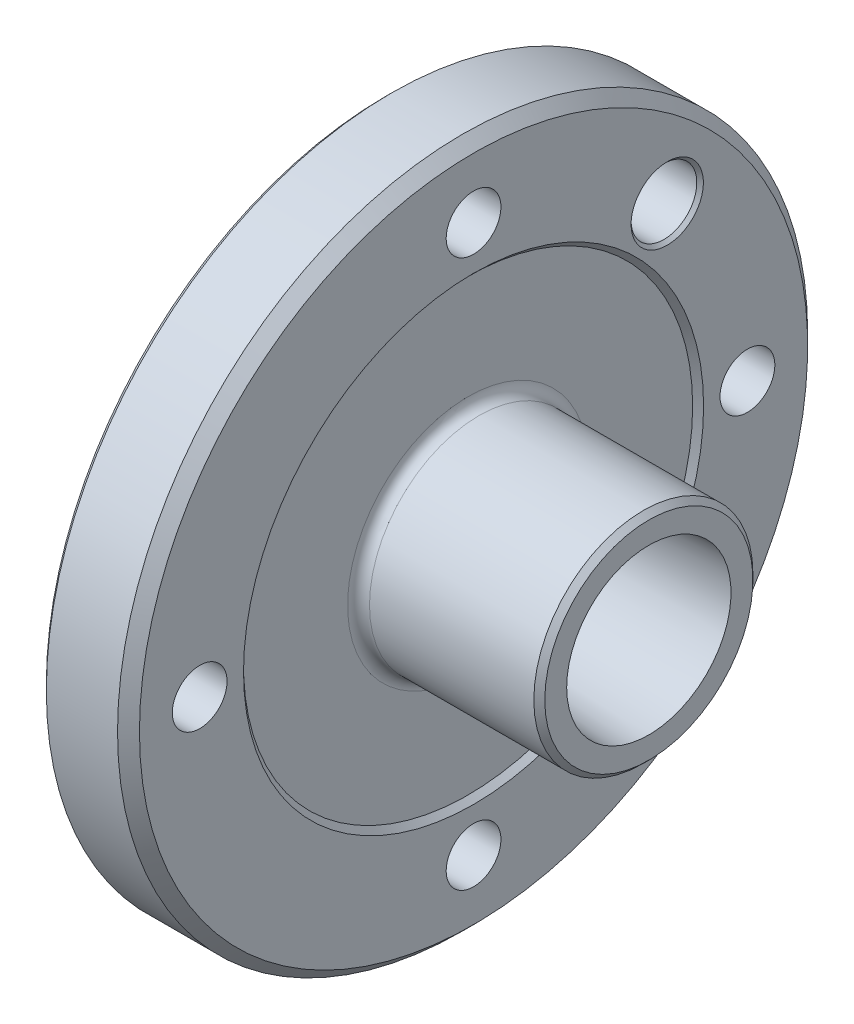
ISO-10303-21;
HEADER;
FILE_DESCRIPTION(('STEP AP214'),'2;1');
FILE_NAME('part.step','',(''),(''),'','','');
FILE_SCHEMA(('AUTOMOTIVE_DESIGN { 1 0 10303 214 1 1 1 1 }'));
ENDSEC;
DATA;
#1=APPLICATION_CONTEXT('core data for automotive mechanical design processes');
#2=APPLICATION_PROTOCOL_DEFINITION('international standard','automotive_design',2000,#1);
#3=PRODUCT_CONTEXT('',#1,'mechanical');
#4=PRODUCT('Part','Part','',(#3));
#5=PRODUCT_RELATED_PRODUCT_CATEGORY('part','',(#4));
#6=PRODUCT_DEFINITION_FORMATION('','',#4);
#7=PRODUCT_DEFINITION_CONTEXT('part definition',#1,'design');
#8=PRODUCT_DEFINITION('design','',#6,#7);
#9=PRODUCT_DEFINITION_SHAPE('','',#8);
#10=(LENGTH_UNIT() NAMED_UNIT(*) SI_UNIT(.MILLI.,.METRE.));
#11=(NAMED_UNIT(*) PLANE_ANGLE_UNIT() SI_UNIT($,.RADIAN.));
#12=(NAMED_UNIT(*) SI_UNIT($,.STERADIAN.) SOLID_ANGLE_UNIT());
#13=UNCERTAINTY_MEASURE_WITH_UNIT(LENGTH_MEASURE(1.E-05),#10,'distance_accuracy_value','');
#14=(GEOMETRIC_REPRESENTATION_CONTEXT(3) GLOBAL_UNCERTAINTY_ASSIGNED_CONTEXT((#13)) GLOBAL_UNIT_ASSIGNED_CONTEXT((#10,
#11,#12)) REPRESENTATION_CONTEXT('',''));
#15=CARTESIAN_POINT('',(0.,0.,0.));
#16=DIRECTION('',(0.,0.,1.));
#17=DIRECTION('',(1.,0.,0.));
#18=AXIS2_PLACEMENT_3D('',#15,#16,#17);
#19=CARTESIAN_POINT('',(5.5,6.575,0.));
#20=DIRECTION('',(-1.,0.,0.));
#21=DIRECTION('',(0.,0.,1.));
#22=AXIS2_PLACEMENT_3D('',#19,#20,#21);
#23=PLANE('',#22);
#24=CARTESIAN_POINT('',(5.5,0.,0.));
#25=DIRECTION('',(-1.,0.,0.));
#26=DIRECTION('',(0.,0.,1.));
#27=AXIS2_PLACEMENT_3D('',#24,#25,#26);
#28=CIRCLE('',#27,3.3);
#29=CARTESIAN_POINT('',(5.5,0.,3.3));
#30=VERTEX_POINT('',#29);
#31=EDGE_CURVE('E94',#30,#30,#28,.T.);
#32=ORIENTED_EDGE('',*,*,#31,.T.);
#33=EDGE_LOOP('',(#32));
#34=FACE_BOUND('',#33,.T.);
#35=CARTESIAN_POINT('',(5.5,0.,0.));
#36=DIRECTION('',(-1.,0.,0.));
#37=DIRECTION('',(0.,0.,1.));
#38=AXIS2_PLACEMENT_3D('',#35,#36,#37);
#39=CIRCLE('',#38,6.575);
#40=CARTESIAN_POINT('',(5.5,0.,6.575));
#41=VERTEX_POINT('',#40);
#42=EDGE_CURVE('E126',#41,#41,#39,.T.);
#43=ORIENTED_EDGE('',*,*,#42,.F.);
#44=EDGE_LOOP('',(#43));
#45=FACE_BOUND('',#44,.T.);
#46=ADVANCED_FACE('F58',(#34,#45),#23,.F.);
#47=CARTESIAN_POINT('',(0.,0.,0.));
#48=DIRECTION('',(1.,0.,0.));
#49=DIRECTION('',(0.,0.,-1.));
#50=AXIS2_PLACEMENT_3D('',#47,#48,#49);
#51=PLANE('',#50);
#52=CARTESIAN_POINT('',(0.,17.6776695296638,-17.6776695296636));
#53=DIRECTION('',(1.,0.,0.));
#54=DIRECTION('',(0.,0.,-1.));
#55=AXIS2_PLACEMENT_3D('',#52,#53,#54);
#56=CIRCLE('',#55,3.30000000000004);
#57=CARTESIAN_POINT('',(0.,17.6776695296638,-20.9776695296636));
#58=VERTEX_POINT('',#57);
#59=EDGE_CURVE('E65',#58,#58,#56,.T.);
#60=ORIENTED_EDGE('',*,*,#59,.T.);
#61=EDGE_LOOP('',(#60));
#62=FACE_BOUND('',#61,.T.);
#63=CARTESIAN_POINT('',(0.,0.,0.));
#64=DIRECTION('',(-1.,0.,0.));
#65=DIRECTION('',(0.,0.,1.));
#66=AXIS2_PLACEMENT_3D('',#63,#64,#65);
#67=CIRCLE('',#66,6.855);
#68=CARTESIAN_POINT('',(0.,0.,6.855));
#69=VERTEX_POINT('',#68);
#70=EDGE_CURVE('E141',#69,#69,#67,.T.);
#71=ORIENTED_EDGE('',*,*,#70,.F.);
#72=EDGE_LOOP('',(#71));
#73=FACE_BOUND('',#72,.T.);
#74=CARTESIAN_POINT('',(0.,0.,0.));
#75=DIRECTION('',(1.,0.,0.));
#76=DIRECTION('',(0.,0.,-1.));
#77=AXIS2_PLACEMENT_3D('',#74,#75,#76);
#78=CIRCLE('',#77,31.);
#79=CARTESIAN_POINT('',(0.,0.,-31.));
#80=VERTEX_POINT('',#79);
#81=EDGE_CURVE('E107',#80,#80,#78,.F.);
#82=ORIENTED_EDGE('',*,*,#81,.T.);
#83=EDGE_LOOP('',(#82));
#84=FACE_BOUND('',#83,.T.);
#85=CARTESIAN_POINT('',(0.,2.61861100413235E-13,25.));
#86=DIRECTION('',(-1.,0.,0.));
#87=DIRECTION('',(0.,0.,1.));
#88=AXIS2_PLACEMENT_3D('',#85,#86,#87);
#89=CIRCLE('',#88,2.5);
#90=CARTESIAN_POINT('',(0.,2.61861100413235E-13,27.5));
#91=VERTEX_POINT('',#90);
#92=EDGE_CURVE('E97',#91,#91,#89,.T.);
#93=ORIENTED_EDGE('',*,*,#92,.F.);
#94=EDGE_LOOP('',(#93));
#95=FACE_BOUND('',#94,.T.);
#96=CARTESIAN_POINT('',(0.,-25.,0.));
#97=DIRECTION('',(-1.,0.,0.));
#98=DIRECTION('',(0.,0.,1.));
#99=AXIS2_PLACEMENT_3D('',#96,#97,#98);
#100=CIRCLE('',#99,2.5);
#101=CARTESIAN_POINT('',(0.,-25.,2.5));
#102=VERTEX_POINT('',#101);
#103=EDGE_CURVE('E114',#102,#102,#100,.T.);
#104=ORIENTED_EDGE('',*,*,#103,.F.);
#105=EDGE_LOOP('',(#104));
#106=FACE_BOUND('',#105,.T.);
#107=CARTESIAN_POINT('',(0.,0.,-25.));
#108=DIRECTION('',(-1.,0.,0.));
#109=DIRECTION('',(0.,0.,1.));
#110=AXIS2_PLACEMENT_3D('',#107,#108,#109);
#111=CIRCLE('',#110,2.5);
#112=CARTESIAN_POINT('',(0.,0.,-22.5));
#113=VERTEX_POINT('',#112);
#114=EDGE_CURVE('E118',#113,#113,#111,.T.);
#115=ORIENTED_EDGE('',*,*,#114,.F.);
#116=EDGE_LOOP('',(#115));
#117=FACE_BOUND('',#116,.T.);
#118=CARTESIAN_POINT('',(0.,25.,0.));
#119=DIRECTION('',(-1.,0.,0.));
#120=DIRECTION('',(0.,0.,1.));
#121=AXIS2_PLACEMENT_3D('',#118,#119,#120);
#122=CIRCLE('',#121,2.5);
#123=CARTESIAN_POINT('',(0.,25.,2.5));
#124=VERTEX_POINT('',#123);
#125=EDGE_CURVE('E122',#124,#124,#122,.T.);
#126=ORIENTED_EDGE('',*,*,#125,.F.);
#127=EDGE_LOOP('',(#126));
#128=FACE_BOUND('',#127,.T.);
#129=ADVANCED_FACE('F165',(#62,#73,#84,#95,#106,#117,#128),#51,.F.);
#130=CARTESIAN_POINT('',(0.,0.,0.));
#131=DIRECTION('',(-1.,0.,0.));
#132=DIRECTION('',(0.,0.,1.));
#133=AXIS2_PLACEMENT_3D('',#130,#131,#132);
#134=CYLINDRICAL_SURFACE('',#133,31.5);
#135=CARTESIAN_POINT('',(7.,0.,0.));
#136=DIRECTION('',(-1.,0.,0.));
#137=DIRECTION('',(0.,0.,1.));
#138=AXIS2_PLACEMENT_3D('',#135,#136,#137);
#139=CIRCLE('',#138,31.5);
#140=CARTESIAN_POINT('',(7.,0.,31.5));
#141=VERTEX_POINT('',#140);
#142=EDGE_CURVE('E90',#141,#141,#139,.T.);
#143=ORIENTED_EDGE('',*,*,#142,.T.);
#144=EDGE_LOOP('',(#143));
#145=FACE_BOUND('',#144,.T.);
#146=CARTESIAN_POINT('',(0.500000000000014,0.,0.));
#147=DIRECTION('',(1.,0.,0.));
#148=DIRECTION('',(0.,0.,-1.));
#149=AXIS2_PLACEMENT_3D('',#146,#147,#148);
#150=CIRCLE('',#149,31.5);
#151=CARTESIAN_POINT('',(0.500000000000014,0.,-31.5));
#152=VERTEX_POINT('',#151);
#153=EDGE_CURVE('E104',#152,#152,#150,.T.);
#154=ORIENTED_EDGE('',*,*,#153,.T.);
#155=EDGE_LOOP('',(#154));
#156=FACE_BOUND('',#155,.T.);
#157=ADVANCED_FACE('F171',(#145,#156),#134,.T.);
#158=CARTESIAN_POINT('',(8.,31.5,0.));
#159=DIRECTION('',(-1.,0.,0.));
#160=DIRECTION('',(0.,0.,1.));
#161=AXIS2_PLACEMENT_3D('',#158,#159,#160);
#162=PLANE('',#161);
#163=CARTESIAN_POINT('',(8.,17.6776695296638,-17.6776695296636));
#164=DIRECTION('',(-1.,0.,0.));
#165=DIRECTION('',(0.,0.,1.));
#166=AXIS2_PLACEMENT_3D('',#163,#164,#165);
#167=CIRCLE('',#166,3.30000000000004);
#168=CARTESIAN_POINT('',(8.,17.6776695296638,-14.3776695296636));
#169=VERTEX_POINT('',#168);
#170=EDGE_CURVE('E11',#169,#169,#167,.T.);
#171=ORIENTED_EDGE('',*,*,#170,.T.);
#172=EDGE_LOOP('',(#171));
#173=FACE_BOUND('',#172,.T.);
#174=CARTESIAN_POINT('',(8.,0.,0.));
#175=DIRECTION('',(-1.,0.,0.));
#176=DIRECTION('',(0.,0.,1.));
#177=AXIS2_PLACEMENT_3D('',#174,#175,#176);
#178=CIRCLE('',#177,21.);
#179=CARTESIAN_POINT('',(8.,0.,21.));
#180=VERTEX_POINT('',#179);
#181=EDGE_CURVE('E78',#180,#180,#178,.T.);
#182=ORIENTED_EDGE('',*,*,#181,.T.);
#183=EDGE_LOOP('',(#182));
#184=FACE_BOUND('',#183,.T.);
#185=CARTESIAN_POINT('',(8.,0.,0.));
#186=DIRECTION('',(-1.,0.,0.));
#187=DIRECTION('',(0.,0.,1.));
#188=AXIS2_PLACEMENT_3D('',#185,#186,#187);
#189=CIRCLE('',#188,30.5);
#190=CARTESIAN_POINT('',(8.,0.,30.5));
#191=VERTEX_POINT('',#190);
#192=EDGE_CURVE('E87',#191,#191,#189,.F.);
#193=ORIENTED_EDGE('',*,*,#192,.T.);
#194=EDGE_LOOP('',(#193));
#195=FACE_BOUND('',#194,.T.);
#196=CARTESIAN_POINT('',(8.,2.61861100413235E-13,25.));
#197=DIRECTION('',(-1.,0.,0.));
#198=DIRECTION('',(0.,0.,1.));
#199=AXIS2_PLACEMENT_3D('',#196,#197,#198);
#200=CIRCLE('',#199,2.5);
#201=CARTESIAN_POINT('',(8.,2.61861100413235E-13,27.5));
#202=VERTEX_POINT('',#201);
#203=EDGE_CURVE('E111',#202,#202,#200,.T.);
#204=ORIENTED_EDGE('',*,*,#203,.T.);
#205=EDGE_LOOP('',(#204));
#206=FACE_BOUND('',#205,.T.);
#207=CARTESIAN_POINT('',(8.,-25.,0.));
#208=DIRECTION('',(-1.,0.,0.));
#209=DIRECTION('',(0.,0.,1.));
#210=AXIS2_PLACEMENT_3D('',#207,#208,#209);
#211=CIRCLE('',#210,2.5);
#212=CARTESIAN_POINT('',(8.,-25.,2.5));
#213=VERTEX_POINT('',#212);
#214=EDGE_CURVE('E115',#213,#213,#211,.T.);
#215=ORIENTED_EDGE('',*,*,#214,.T.);
#216=EDGE_LOOP('',(#215));
#217=FACE_BOUND('',#216,.T.);
#218=CARTESIAN_POINT('',(8.,0.,-25.));
#219=DIRECTION('',(-1.,0.,0.));
#220=DIRECTION('',(0.,0.,1.));
#221=AXIS2_PLACEMENT_3D('',#218,#219,#220);
#222=CIRCLE('',#221,2.5);
#223=CARTESIAN_POINT('',(8.,0.,-22.5));
#224=VERTEX_POINT('',#223);
#225=EDGE_CURVE('E119',#224,#224,#222,.T.);
#226=ORIENTED_EDGE('',*,*,#225,.T.);
#227=EDGE_LOOP('',(#226));
#228=FACE_BOUND('',#227,.T.);
#229=CARTESIAN_POINT('',(8.,25.,0.));
#230=DIRECTION('',(-1.,0.,0.));
#231=DIRECTION('',(0.,0.,1.));
#232=AXIS2_PLACEMENT_3D('',#229,#230,#231);
#233=CIRCLE('',#232,2.5);
#234=CARTESIAN_POINT('',(8.,25.,2.5));
#235=VERTEX_POINT('',#234);
#236=EDGE_CURVE('E123',#235,#235,#233,.T.);
#237=ORIENTED_EDGE('',*,*,#236,.T.);
#238=EDGE_LOOP('',(#237));
#239=FACE_BOUND('',#238,.T.);
#240=ADVANCED_FACE('F204',(#173,#184,#195,#206,#217,#228,#239),#162,.F.);
#241=CARTESIAN_POINT('',(0.,0.,0.));
#242=DIRECTION('',(-1.,0.,0.));
#243=DIRECTION('',(0.,0.,1.));
#244=AXIS2_PLACEMENT_3D('',#241,#242,#243);
#245=CYLINDRICAL_SURFACE('',#244,10.);
#246=CARTESIAN_POINT('',(8.5,0.,0.));
#247=DIRECTION('',(1.,0.,0.));
#248=DIRECTION('',(0.,0.,-1.));
#249=AXIS2_PLACEMENT_3D('',#246,#247,#248);
#250=CIRCLE('',#249,10.);
#251=CARTESIAN_POINT('',(8.5,0.,-10.));
#252=VERTEX_POINT('',#251);
#253=EDGE_CURVE('E84',#252,#252,#250,.T.);
#254=ORIENTED_EDGE('',*,*,#253,.T.);
#255=EDGE_LOOP('',(#254));
#256=FACE_BOUND('',#255,.T.);
#257=CARTESIAN_POINT('',(23.5,0.,0.));
#258=DIRECTION('',(-1.,0.,0.));
#259=DIRECTION('',(0.,0.,1.));
#260=AXIS2_PLACEMENT_3D('',#257,#258,#259);
#261=CIRCLE('',#260,10.);
#262=CARTESIAN_POINT('',(23.5,0.,10.));
#263=VERTEX_POINT('',#262);
#264=EDGE_CURVE('E101',#263,#263,#261,.T.);
#265=ORIENTED_EDGE('',*,*,#264,.T.);
#266=EDGE_LOOP('',(#265));
#267=FACE_BOUND('',#266,.T.);
#268=ADVANCED_FACE('F227',(#256,#267),#245,.T.);
#269=CARTESIAN_POINT('',(24.,10.,0.));
#270=DIRECTION('',(-1.,0.,0.));
#271=DIRECTION('',(0.,0.,1.));
#272=AXIS2_PLACEMENT_3D('',#269,#270,#271);
#273=PLANE('',#272);
#274=CARTESIAN_POINT('',(24.,0.,0.));
#275=DIRECTION('',(-1.,0.,0.));
#276=DIRECTION('',(0.,0.,1.));
#277=AXIS2_PLACEMENT_3D('',#274,#275,#276);
#278=CIRCLE('',#277,9.5);
#279=CARTESIAN_POINT('',(24.,0.,9.5));
#280=VERTEX_POINT('',#279);
#281=EDGE_CURVE('E93',#280,#280,#278,.F.);
#282=ORIENTED_EDGE('',*,*,#281,.T.);
#283=EDGE_LOOP('',(#282));
#284=FACE_BOUND('',#283,.T.);
#285=CARTESIAN_POINT('',(24.,0.,0.));
#286=DIRECTION('',(-1.,0.,0.));
#287=DIRECTION('',(0.,0.,1.));
#288=AXIS2_PLACEMENT_3D('',#285,#286,#287);
#289=CIRCLE('',#288,7.5);
#290=CARTESIAN_POINT('',(24.,0.,7.5));
#291=VERTEX_POINT('',#290);
#292=EDGE_CURVE('E110',#291,#291,#289,.T.);
#293=ORIENTED_EDGE('',*,*,#292,.T.);
#294=EDGE_LOOP('',(#293));
#295=FACE_BOUND('',#294,.T.);
#296=ADVANCED_FACE('F232',(#284,#295),#273,.F.);
#297=CARTESIAN_POINT('',(5.5,0.,0.));
#298=DIRECTION('',(1.,0.,0.));
#299=DIRECTION('',(0.,0.,-1.));
#300=AXIS2_PLACEMENT_3D('',#297,#298,#299);
#301=CONICAL_SURFACE('',#300,6.575,0.0499583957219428);
#302=ORIENTED_EDGE('',*,*,#292,.F.);
#303=EDGE_LOOP('',(#302));
#304=FACE_BOUND('',#303,.T.);
#305=ORIENTED_EDGE('',*,*,#42,.T.);
#306=EDGE_LOOP('',(#305));
#307=FACE_BOUND('',#306,.T.);
#308=ADVANCED_FACE('F222',(#304,#307),#301,.F.);
#309=CARTESIAN_POINT('',(0.,25.,0.));
#310=DIRECTION('',(-1.,0.,0.));
#311=DIRECTION('',(0.,0.,1.));
#312=AXIS2_PLACEMENT_3D('',#309,#310,#311);
#313=CYLINDRICAL_SURFACE('',#312,2.5);
#314=ORIENTED_EDGE('',*,*,#125,.T.);
#315=EDGE_LOOP('',(#314));
#316=FACE_BOUND('',#315,.T.);
#317=ORIENTED_EDGE('',*,*,#236,.F.);
#318=EDGE_LOOP('',(#317));
#319=FACE_BOUND('',#318,.T.);
#320=ADVANCED_FACE('F218',(#316,#319),#313,.F.);
#321=CARTESIAN_POINT('',(0.,0.,-25.));
#322=DIRECTION('',(-1.,0.,0.));
#323=DIRECTION('',(0.,0.,1.));
#324=AXIS2_PLACEMENT_3D('',#321,#322,#323);
#325=CYLINDRICAL_SURFACE('',#324,2.5);
#326=ORIENTED_EDGE('',*,*,#114,.T.);
#327=EDGE_LOOP('',(#326));
#328=FACE_BOUND('',#327,.T.);
#329=ORIENTED_EDGE('',*,*,#225,.F.);
#330=EDGE_LOOP('',(#329));
#331=FACE_BOUND('',#330,.T.);
#332=ADVANCED_FACE('F221',(#328,#331),#325,.F.);
#333=CARTESIAN_POINT('',(0.,-25.,0.));
#334=DIRECTION('',(-1.,0.,0.));
#335=DIRECTION('',(0.,0.,1.));
#336=AXIS2_PLACEMENT_3D('',#333,#334,#335);
#337=CYLINDRICAL_SURFACE('',#336,2.5);
#338=ORIENTED_EDGE('',*,*,#103,.T.);
#339=EDGE_LOOP('',(#338));
#340=FACE_BOUND('',#339,.T.);
#341=ORIENTED_EDGE('',*,*,#214,.F.);
#342=EDGE_LOOP('',(#341));
#343=FACE_BOUND('',#342,.T.);
#344=ADVANCED_FACE('F245',(#340,#343),#337,.F.);
#345=CARTESIAN_POINT('',(0.,2.61861100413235E-13,25.));
#346=DIRECTION('',(-1.,0.,0.));
#347=DIRECTION('',(0.,0.,1.));
#348=AXIS2_PLACEMENT_3D('',#345,#346,#347);
#349=CYLINDRICAL_SURFACE('',#348,2.5);
#350=ORIENTED_EDGE('',*,*,#92,.T.);
#351=EDGE_LOOP('',(#350));
#352=FACE_BOUND('',#351,.T.);
#353=ORIENTED_EDGE('',*,*,#203,.F.);
#354=EDGE_LOOP('',(#353));
#355=FACE_BOUND('',#354,.T.);
#356=ADVANCED_FACE('F249',(#352,#355),#349,.F.);
#357=CARTESIAN_POINT('',(24.001,17.6776695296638,-17.6776695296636));
#358=DIRECTION('',(-1.,0.,0.));
#359=DIRECTION('',(0.,0.,1.));
#360=AXIS2_PLACEMENT_3D('',#357,#358,#359);
#361=CYLINDRICAL_SURFACE('',#360,3.);
#362=CARTESIAN_POINT('',(0.300000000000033,17.6776695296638,-17.6776695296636));
#363=DIRECTION('',(1.,0.,0.));
#364=DIRECTION('',(0.,0.,-1.));
#365=AXIS2_PLACEMENT_3D('',#362,#363,#364);
#366=CIRCLE('',#365,3.);
#367=CARTESIAN_POINT('',(0.300000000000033,17.6776695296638,-14.6776695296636));
#368=VERTEX_POINT('',#367);
#369=EDGE_CURVE('E69',#368,#368,#366,.F.);
#370=CARTESIAN_POINT('',(7.69999999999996,17.6776695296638,-17.6776695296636));
#371=DIRECTION('',(-1.,0.,0.));
#372=DIRECTION('',(0.,0.,1.));
#373=AXIS2_PLACEMENT_3D('',#370,#371,#372);
#374=CIRCLE('',#373,3.);
#375=CARTESIAN_POINT('',(7.69999999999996,17.6776695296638,-14.6776695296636));
#376=VERTEX_POINT('',#375);
#377=EDGE_CURVE('E73',#376,#376,#374,.F.);
#378=CARTESIAN_POINT('',(0.300000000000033,17.6776695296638,-14.6776695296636));
#379=CARTESIAN_POINT('',(0.377083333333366,17.6776695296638,-14.6776695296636));
#380=CARTESIAN_POINT('',(0.454166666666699,17.6776695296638,-14.6776695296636));
#381=CARTESIAN_POINT('',(0.608333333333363,17.6776695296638,-14.6776695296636));
#382=CARTESIAN_POINT('',(0.685416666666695,17.6776695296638,-14.6776695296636));
#383=CARTESIAN_POINT('',(0.83958333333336,17.6776695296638,-14.6776695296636));
#384=CARTESIAN_POINT('',(0.916666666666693,17.6776695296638,-14.6776695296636));
#385=CARTESIAN_POINT('',(1.07083333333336,17.6776695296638,-14.6776695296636));
#386=CARTESIAN_POINT('',(1.14791666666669,17.6776695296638,-14.6776695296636));
#387=CARTESIAN_POINT('',(1.30208333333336,17.6776695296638,-14.6776695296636));
#388=CARTESIAN_POINT('',(1.37916666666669,17.6776695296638,-14.6776695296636));
#389=CARTESIAN_POINT('',(1.53333333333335,17.6776695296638,-14.6776695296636));
#390=CARTESIAN_POINT('',(1.61041666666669,17.6776695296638,-14.6776695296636));
#391=CARTESIAN_POINT('',(1.76458333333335,17.6776695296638,-14.6776695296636));
#392=CARTESIAN_POINT('',(1.84166666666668,17.6776695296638,-14.6776695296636));
#393=CARTESIAN_POINT('',(1.99583333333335,17.6776695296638,-14.6776695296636));
#394=CARTESIAN_POINT('',(2.07291666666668,17.6776695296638,-14.6776695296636));
#395=CARTESIAN_POINT('',(2.22708333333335,17.6776695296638,-14.6776695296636));
#396=CARTESIAN_POINT('',(2.30416666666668,17.6776695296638,-14.6776695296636));
#397=CARTESIAN_POINT('',(2.45833333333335,17.6776695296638,-14.6776695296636));
#398=CARTESIAN_POINT('',(2.53541666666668,17.6776695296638,-14.6776695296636));
#399=CARTESIAN_POINT('',(2.68958333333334,17.6776695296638,-14.6776695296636));
#400=CARTESIAN_POINT('',(2.76666666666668,17.6776695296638,-14.6776695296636));
#401=CARTESIAN_POINT('',(2.92083333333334,17.6776695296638,-14.6776695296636));
#402=CARTESIAN_POINT('',(2.99791666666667,17.6776695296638,-14.6776695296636));
#403=CARTESIAN_POINT('',(3.15208333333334,17.6776695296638,-14.6776695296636));
#404=CARTESIAN_POINT('',(3.22916666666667,17.6776695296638,-14.6776695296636));
#405=CARTESIAN_POINT('',(3.38333333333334,17.6776695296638,-14.6776695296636));
#406=CARTESIAN_POINT('',(3.46041666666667,17.6776695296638,-14.6776695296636));
#407=CARTESIAN_POINT('',(3.61458333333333,17.6776695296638,-14.6776695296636));
#408=CARTESIAN_POINT('',(3.69166666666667,17.6776695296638,-14.6776695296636));
#409=CARTESIAN_POINT('',(3.84583333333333,17.6776695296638,-14.6776695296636));
#410=CARTESIAN_POINT('',(3.92291666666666,17.6776695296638,-14.6776695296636));
#411=CARTESIAN_POINT('',(4.07708333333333,17.6776695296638,-14.6776695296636));
#412=CARTESIAN_POINT('',(4.15416666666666,17.6776695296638,-14.6776695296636));
#413=CARTESIAN_POINT('',(4.30833333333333,17.6776695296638,-14.6776695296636));
#414=CARTESIAN_POINT('',(4.38541666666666,17.6776695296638,-14.6776695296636));
#415=CARTESIAN_POINT('',(4.53958333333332,17.6776695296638,-14.6776695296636));
#416=CARTESIAN_POINT('',(4.61666666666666,17.6776695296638,-14.6776695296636));
#417=CARTESIAN_POINT('',(4.77083333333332,17.6776695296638,-14.6776695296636));
#418=CARTESIAN_POINT('',(4.84791666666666,17.6776695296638,-14.6776695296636));
#419=CARTESIAN_POINT('',(5.00208333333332,17.6776695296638,-14.6776695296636));
#420=CARTESIAN_POINT('',(5.07916666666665,17.6776695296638,-14.6776695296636));
#421=CARTESIAN_POINT('',(5.23333333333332,17.6776695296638,-14.6776695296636));
#422=CARTESIAN_POINT('',(5.31041666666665,17.6776695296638,-14.6776695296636));
#423=CARTESIAN_POINT('',(5.46458333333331,17.6776695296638,-14.6776695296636));
#424=CARTESIAN_POINT('',(5.54166666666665,17.6776695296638,-14.6776695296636));
#425=CARTESIAN_POINT('',(5.69583333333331,17.6776695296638,-14.6776695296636));
#426=CARTESIAN_POINT('',(5.77291666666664,17.6776695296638,-14.6776695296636));
#427=CARTESIAN_POINT('',(5.92708333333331,17.6776695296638,-14.6776695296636));
#428=CARTESIAN_POINT('',(6.00416666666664,17.6776695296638,-14.6776695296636));
#429=CARTESIAN_POINT('',(6.15833333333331,17.6776695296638,-14.6776695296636));
#430=CARTESIAN_POINT('',(6.23541666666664,17.6776695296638,-14.6776695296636));
#431=CARTESIAN_POINT('',(6.38958333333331,17.6776695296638,-14.6776695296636));
#432=CARTESIAN_POINT('',(6.46666666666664,17.6776695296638,-14.6776695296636));
#433=CARTESIAN_POINT('',(6.6208333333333,17.6776695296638,-14.6776695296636));
#434=CARTESIAN_POINT('',(6.69791666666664,17.6776695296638,-14.6776695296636));
#435=CARTESIAN_POINT('',(6.8520833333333,17.6776695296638,-14.6776695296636));
#436=CARTESIAN_POINT('',(6.92916666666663,17.6776695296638,-14.6776695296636));
#437=CARTESIAN_POINT('',(7.0833333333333,17.6776695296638,-14.6776695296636));
#438=CARTESIAN_POINT('',(7.16041666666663,17.6776695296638,-14.6776695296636));
#439=CARTESIAN_POINT('',(7.3145833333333,17.6776695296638,-14.6776695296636));
#440=CARTESIAN_POINT('',(7.39166666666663,17.6776695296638,-14.6776695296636));
#441=CARTESIAN_POINT('',(7.54583333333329,17.6776695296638,-14.6776695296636));
#442=CARTESIAN_POINT('',(7.62291666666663,17.6776695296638,-14.6776695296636));
#443=CARTESIAN_POINT('',(7.69999999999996,17.6776695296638,-14.6776695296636));
#444=B_SPLINE_CURVE_WITH_KNOTS('',3,(#378,#379,#380,#381,#382,#383,#384,#385,#386,#387,#388,
#389,#390,#391,#392,#393,#394,#395,#396,#397,#398,#399,#400,#401,#402,#403,#404,#405,#406,#407,
#408,#409,#410,#411,#412,#413,#414,#415,#416,#417,#418,#419,#420,#421,#422,#423,#424,#425,#426,
#427,#428,#429,#430,#431,#432,#433,#434,#435,#436,#437,#438,#439,#440,#441,#442,#443),
.UNSPECIFIED.,.F.,.F.,(4,2,2,2,2,2,2,2,2,2,2,2,2,2,2,2,2,2,2,2,2,2,2,2,2,2,2,2,2,2,2,2,4),(0.,
0.231249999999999,0.462499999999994,0.693749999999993,0.924999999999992,1.15624999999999,
1.38749999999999,1.61874999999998,1.84999999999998,2.08124999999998,2.31249999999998,
2.54374999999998,2.77499999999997,3.00624999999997,3.23749999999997,3.46874999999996,
3.69999999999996,3.93124999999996,4.16249999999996,4.39374999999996,4.62499999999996,
4.85624999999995,5.08749999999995,5.31874999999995,5.54999999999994,5.78124999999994,
6.01249999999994,6.24374999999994,6.47499999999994,6.70624999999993,6.93749999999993,
7.16874999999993,7.39999999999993),.UNSPECIFIED.);
#445=EDGE_CURVE('BSEAM180',#368,#376,#444,.T.);
#446=ORIENTED_EDGE('',*,*,#369,.T.);
#447=ORIENTED_EDGE('',*,*,#377,.T.);
#448=ORIENTED_EDGE('',*,*,#445,.T.);
#449=ORIENTED_EDGE('',*,*,#445,.F.);
#450=EDGE_LOOP('',(#446,#448,#447,#449));
#451=FACE_BOUND('',#450,.T.);
#452=ADVANCED_FACE('F180',(#451),#361,.F.);
#453=CARTESIAN_POINT('',(0.,0.,0.));
#454=DIRECTION('',(1.,0.,0.));
#455=DIRECTION('',(0.,0.,-1.));
#456=AXIS2_PLACEMENT_3D('',#453,#454,#455);
#457=CONICAL_SURFACE('',#456,31.,0.785398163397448);
#458=ORIENTED_EDGE('',*,*,#153,.F.);
#459=EDGE_LOOP('',(#458));
#460=FACE_BOUND('',#459,.T.);
#461=ORIENTED_EDGE('',*,*,#81,.F.);
#462=EDGE_LOOP('',(#461));
#463=FACE_BOUND('',#462,.T.);
#464=ADVANCED_FACE('F176',(#460,#463),#457,.T.);
#465=CARTESIAN_POINT('',(23.5,0.,0.));
#466=DIRECTION('',(-1.,0.,0.));
#467=DIRECTION('',(0.,0.,1.));
#468=AXIS2_PLACEMENT_3D('',#465,#466,#467);
#469=CONICAL_SURFACE('',#468,10.,0.785398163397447);
#470=ORIENTED_EDGE('',*,*,#281,.F.);
#471=EDGE_LOOP('',(#470));
#472=FACE_BOUND('',#471,.T.);
#473=ORIENTED_EDGE('',*,*,#264,.F.);
#474=EDGE_LOOP('',(#473));
#475=FACE_BOUND('',#474,.T.);
#476=ADVANCED_FACE('F179',(#472,#475),#469,.T.);
#477=CARTESIAN_POINT('',(0.,0.,0.));
#478=DIRECTION('',(-1.,0.,0.));
#479=DIRECTION('',(0.,0.,1.));
#480=AXIS2_PLACEMENT_3D('',#477,#478,#479);
#481=CYLINDRICAL_SURFACE('',#480,3.3);
#482=CARTESIAN_POINT('',(3.555,0.,0.));
#483=DIRECTION('',(-1.,0.,0.));
#484=DIRECTION('',(0.,0.,1.));
#485=AXIS2_PLACEMENT_3D('',#482,#483,#484);
#486=CIRCLE('',#485,3.3);
#487=CARTESIAN_POINT('',(3.555,0.,3.3));
#488=VERTEX_POINT('',#487);
#489=EDGE_CURVE('E98',#488,#488,#486,.T.);
#490=ORIENTED_EDGE('',*,*,#489,.T.);
#491=EDGE_LOOP('',(#490));
#492=FACE_BOUND('',#491,.T.);
#493=ORIENTED_EDGE('',*,*,#31,.F.);
#494=EDGE_LOOP('',(#493));
#495=FACE_BOUND('',#494,.T.);
#496=ADVANCED_FACE('F184',(#492,#495),#481,.F.);
#497=CARTESIAN_POINT('',(0.,0.,0.));
#498=DIRECTION('',(-1.,0.,0.));
#499=DIRECTION('',(0.,0.,1.));
#500=AXIS2_PLACEMENT_3D('',#497,#498,#499);
#501=CONICAL_SURFACE('',#500,6.855,0.785398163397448);
#502=ORIENTED_EDGE('',*,*,#489,.F.);
#503=EDGE_LOOP('',(#502));
#504=FACE_BOUND('',#503,.T.);
#505=ORIENTED_EDGE('',*,*,#70,.T.);
#506=EDGE_LOOP('',(#505));
#507=FACE_BOUND('',#506,.T.);
#508=ADVANCED_FACE('F188',(#504,#507),#501,.F.);
#509=CARTESIAN_POINT('',(7.,0.,0.));
#510=DIRECTION('',(-1.,0.,0.));
#511=DIRECTION('',(0.,0.,1.));
#512=AXIS2_PLACEMENT_3D('',#509,#510,#511);
#513=CONICAL_SURFACE('',#512,31.5,0.785398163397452);
#514=ORIENTED_EDGE('',*,*,#192,.F.);
#515=EDGE_LOOP('',(#514));
#516=FACE_BOUND('',#515,.T.);
#517=ORIENTED_EDGE('',*,*,#142,.F.);
#518=EDGE_LOOP('',(#517));
#519=FACE_BOUND('',#518,.T.);
#520=ADVANCED_FACE('F186',(#516,#519),#513,.T.);
#521=CARTESIAN_POINT('',(7.5,0.,0.));
#522=DIRECTION('',(1.,0.,0.));
#523=DIRECTION('',(0.,0.,-1.));
#524=AXIS2_PLACEMENT_3D('',#521,#522,#523);
#525=PLANE('',#524);
#526=CARTESIAN_POINT('',(7.5,0.,0.));
#527=DIRECTION('',(1.,0.,0.));
#528=DIRECTION('',(0.,0.,-1.));
#529=AXIS2_PLACEMENT_3D('',#526,#527,#528);
#530=CIRCLE('',#529,11.);
#531=CARTESIAN_POINT('',(7.5,0.,-11.));
#532=VERTEX_POINT('',#531);
#533=EDGE_CURVE('E81',#532,#532,#530,.F.);
#534=ORIENTED_EDGE('',*,*,#533,.T.);
#535=EDGE_LOOP('',(#534));
#536=FACE_BOUND('',#535,.T.);
#537=CARTESIAN_POINT('',(7.5,0.,0.));
#538=DIRECTION('',(1.,0.,0.));
#539=DIRECTION('',(0.,0.,-1.));
#540=AXIS2_PLACEMENT_3D('',#537,#538,#539);
#541=CIRCLE('',#540,20.5);
#542=CARTESIAN_POINT('',(7.5,0.,-20.5));
#543=VERTEX_POINT('',#542);
#544=EDGE_CURVE('E144',#543,#543,#541,.T.);
#545=ORIENTED_EDGE('',*,*,#544,.T.);
#546=EDGE_LOOP('',(#545));
#547=FACE_BOUND('',#546,.T.);
#548=ADVANCED_FACE('F148',(#536,#547),#525,.T.);
#549=CARTESIAN_POINT('',(8.5,0.,0.));
#550=DIRECTION('',(1.,0.,0.));
#551=DIRECTION('',(0.,0.,-1.));
#552=AXIS2_PLACEMENT_3D('',#549,#550,#551);
#553=TOROIDAL_SURFACE('',#552,11.,1.);
#554=ORIENTED_EDGE('',*,*,#533,.F.);
#555=EDGE_LOOP('',(#554));
#556=FACE_BOUND('',#555,.T.);
#557=ORIENTED_EDGE('',*,*,#253,.F.);
#558=EDGE_LOOP('',(#557));
#559=FACE_BOUND('',#558,.T.);
#560=ADVANCED_FACE('F153',(#556,#559),#553,.F.);
#561=CARTESIAN_POINT('',(7.50000000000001,0.,0.));
#562=DIRECTION('',(1.,0.,0.));
#563=DIRECTION('',(0.,0.,-1.));
#564=AXIS2_PLACEMENT_3D('',#561,#562,#563);
#565=CONICAL_SURFACE('',#564,20.5,0.785398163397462);
#566=ORIENTED_EDGE('',*,*,#181,.F.);
#567=EDGE_LOOP('',(#566));
#568=FACE_BOUND('',#567,.T.);
#569=ORIENTED_EDGE('',*,*,#544,.F.);
#570=EDGE_LOOP('',(#569));
#571=FACE_BOUND('',#570,.T.);
#572=ADVANCED_FACE('F150',(#568,#571),#565,.F.);
#573=CARTESIAN_POINT('',(0.300000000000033,17.6776695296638,-17.6776695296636));
#574=DIRECTION('',(-1.,0.,0.));
#575=DIRECTION('',(0.,0.,1.));
#576=AXIS2_PLACEMENT_3D('',#573,#574,#575);
#577=CONICAL_SURFACE('',#576,3.,0.785398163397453);
#578=ORIENTED_EDGE('',*,*,#59,.F.);
#579=EDGE_LOOP('',(#578));
#580=FACE_BOUND('',#579,.T.);
#581=ORIENTED_EDGE('',*,*,#369,.F.);
#582=EDGE_LOOP('',(#581));
#583=FACE_BOUND('',#582,.T.);
#584=ADVANCED_FACE('F152',(#580,#583),#577,.F.);
#585=CARTESIAN_POINT('',(7.69999999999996,17.6776695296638,-17.6776695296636));
#586=DIRECTION('',(1.,0.,0.));
#587=DIRECTION('',(0.,0.,-1.));
#588=AXIS2_PLACEMENT_3D('',#585,#586,#587);
#589=CONICAL_SURFACE('',#588,3.,0.78539816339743);
#590=ORIENTED_EDGE('',*,*,#170,.F.);
#591=EDGE_LOOP('',(#590));
#592=FACE_BOUND('',#591,.T.);
#593=ORIENTED_EDGE('',*,*,#377,.F.);
#594=EDGE_LOOP('',(#593));
#595=FACE_BOUND('',#594,.T.);
#596=ADVANCED_FACE('F60',(#592,#595),#589,.F.);
#597=CLOSED_SHELL('',(#46,#129,#157,#240,#268,#296,#308,#320,#332,#344,#356,#452,#464,#476,#496,
#508,#520,#548,#560,#572,#584,#596));
#598=MANIFOLD_SOLID_BREP('B2',#597);
#599=ADVANCED_BREP_SHAPE_REPRESENTATION('',(#18,#598),#14);
#600=SHAPE_DEFINITION_REPRESENTATION(#9,#599);
ENDSEC;
END-ISO-10303-21;
